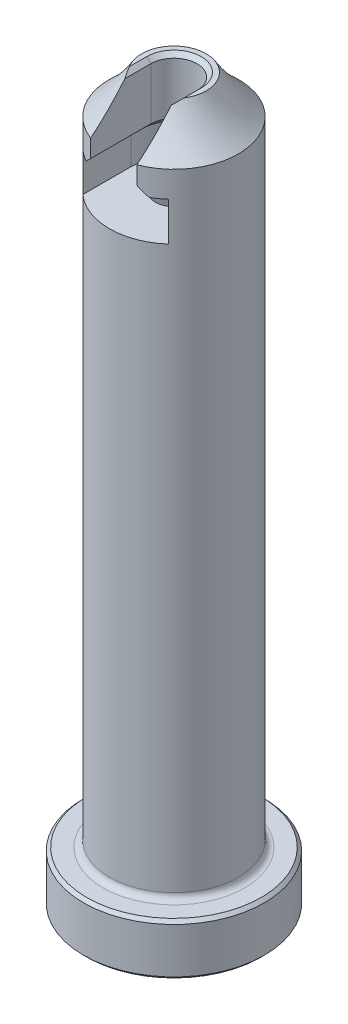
from build123d import *

# Parameters (mm, degrees)
SKETCH2_R          = 2.286
CUT_EXTRUDE1_DEPTH = 91.278376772
CUT_EXTRUDE2_START = 4.7752
CUT_EXTRUDE2_DEPTH = 4.7752
CUT_EXTRUDE3_REACH = 92.278
CHAMFER1_SIZE      = 1.016
CHAMFER3_SIZE      = 0.381
CHAMFER4_SIZE      = 0.762
CHAMFER8_SIZE      = 0.508
FILLET1_R          = 0.762


with BuildPart() as part:
    # Sketch1 → Revolve1 (revolve)
    with BuildSketch(Plane.XY, mode=Mode.PRIVATE) as revolve1_sk:
        with BuildLine():
            Line((0, 0), (-11.1125, 0))
            Line((-11.1125, 0), (-11.1125, 6.35))
            Line((-11.1125, 6.35), (-7.9375, 6.35))
            Line((-7.9375, 6.35), (-7.9375, 84.1756))
            ThreePointArc((-7.9375, 84.1756), (-5.757274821, 86.375683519), (-3.9624, 88.9))
            Line((-3.9624, 88.9), (0, 88.9))
            Line((0, 88.9), (0, 0))
        make_face()
    revolve(revolve1_sk.sketch.rotate(Axis((0, 260.104415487, 0), (0, -1, 0)), 270), axis=Axis((0, 260.104415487, 0), (0, -1, 0)))

    # Sketch2 → Cut-Extrude1 (cut, through all)
    with BuildSketch(Plane.XZ):
        with Locations(Location((0, 0, 0), (0, 0, 270))):
            Circle(SKETCH2_R)
    extrude(amount=-CUT_EXTRUDE1_DEPTH, mode=Mode.SUBTRACT)

    # Sketch3 → Cut-Revolve1 (revolve, cut)
    with BuildSketch(Plane.XY, mode=Mode.PRIVATE) as cut_revolve1_sk:
        Polygon((0, 88.9), (0, 76.2), (-5.2832, 76.2), (-5.2832, 80.9752), (-2.8448, 80.9752), (-2.8448, 88.9), align=None)
    revolve(cut_revolve1_sk.sketch.rotate(Axis((0, 234.452866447, 0), (0, -1, 0)), 270), axis=Axis((0, 234.452866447, 0), (0, -1, 0)), mode=Mode.SUBTRACT)

    # Sketch4 → Cut-Extrude2 (cut)
    with BuildSketch(Plane(origin=(0, 76.2, 0), x_dir=(1, 0, 0), z_dir=(0, 1, 0)).offset(CUT_EXTRUDE2_START)):
        with BuildLine():
            Line((-5.2832, 0), (-5.2832, -5.923825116))
            ThreePointArc((-5.2832, -5.923825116), (0, -7.9375), (5.2832, -5.923825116))
            Line((5.2832, -5.923825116), (5.2832, 0))
            ThreePointArc((5.2832, 0), (0, 5.2832), (-5.2832, 0))
        make_face()
    extrude(amount=-CUT_EXTRUDE2_DEPTH, mode=Mode.SUBTRACT)

    # Sketch5 → Cut-Extrude3 (cut, up to next)
    with BuildSketch(Plane(origin=(0, 88.9, 0), x_dir=(1, 0, 0), z_dir=(0, 1, 0)), mode=Mode.PRIVATE) as cut_extrude3_sk1:
        with BuildLine():
            Line((-2.8448, 0), (-2.8448, -7.410196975))
            ThreePointArc((-2.8448, -7.410196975), (0, -7.9375), (2.8448, -7.410196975))
            Line((2.8448, -7.410196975), (2.8448, 0))
            ThreePointArc((2.8448, 0), (0, 2.8448), (-2.8448, 0))
        make_face()
    cut_extrude3_tool1 = extrude(cut_extrude3_sk1.sketch, amount=-CUT_EXTRUDE3_REACH, mode=Mode.PRIVATE) & part.part
    add(cut_extrude3_tool1.solids().sort_by_distance((0, 88.9, 2.74598))[0], mode=Mode.SUBTRACT)

    # Chamfer1
    chamfer1_edges = [part.edges().sort_by_distance(p)[0] for p in [
        (0, 80.9752, -2.8448),
        (2.8448, 80.9752, 3.705098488),
        (-2.8448, 80.9752, 3.705098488),
    ]]
    chamfer(chamfer1_edges, length=CHAMFER1_SIZE)

    # Chamfer3
    chamfer3_edges = [part.edges().sort_by_distance(p)[0] for p in [
        (0, 6.35, -11.1125),
        (0, 0, -11.1125),
    ]]
    chamfer(chamfer3_edges, length=CHAMFER3_SIZE)

    # Chamfer4
    chamfer4_edges = [part.edges().sort_by_distance(p)[0] for p in [
        (0, 0, 2.286),
    ]]
    chamfer(chamfer4_edges, length=CHAMFER4_SIZE)

    # Chamfer8
    chamfer8_edges = [part.edges().sort_by_distance(p)[0] for p in [
        (2.8448, 88.9, 1.379105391),
        (0, 88.9, -2.8448),
        (-2.8448, 88.9, 1.379105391),
    ]]
    chamfer(chamfer8_edges, length=CHAMFER8_SIZE)

    # Fillet1
    fillet1_edges = [part.edges().sort_by_distance(p)[0] for p in [
        (0, 6.35, -7.9375),
    ]]
    fillet(fillet1_edges, radius=FILLET1_R)


solid = part.part
